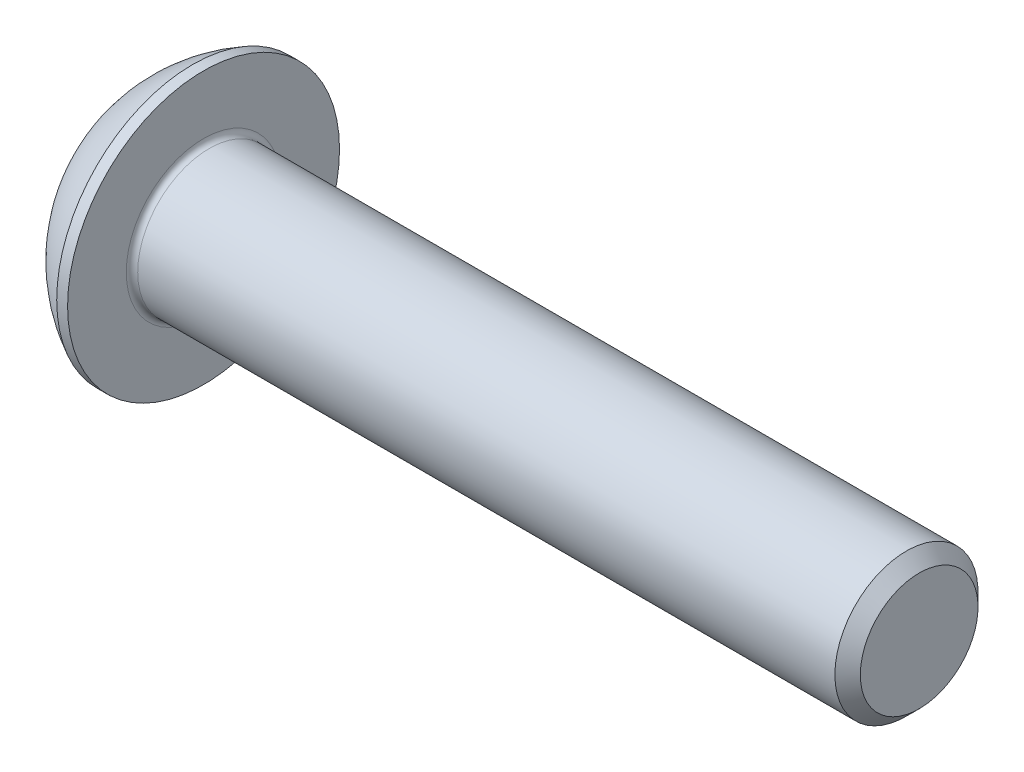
ISO-10303-21;
HEADER;
FILE_DESCRIPTION(('STEP AP214'),'2;1');
FILE_NAME('part.step','',(''),(''),'','','');
FILE_SCHEMA(('AUTOMOTIVE_DESIGN { 1 0 10303 214 1 1 1 1 }'));
ENDSEC;
DATA;
#1=APPLICATION_CONTEXT('core data for automotive mechanical design processes');
#2=APPLICATION_PROTOCOL_DEFINITION('international standard','automotive_design',2000,#1);
#3=PRODUCT_CONTEXT('',#1,'mechanical');
#4=PRODUCT('Part','Part','',(#3));
#5=PRODUCT_RELATED_PRODUCT_CATEGORY('part','',(#4));
#6=PRODUCT_DEFINITION_FORMATION('','',#4);
#7=PRODUCT_DEFINITION_CONTEXT('part definition',#1,'design');
#8=PRODUCT_DEFINITION('design','',#6,#7);
#9=PRODUCT_DEFINITION_SHAPE('','',#8);
#10=(LENGTH_UNIT() NAMED_UNIT(*) SI_UNIT(.MILLI.,.METRE.));
#11=(NAMED_UNIT(*) PLANE_ANGLE_UNIT() SI_UNIT($,.RADIAN.));
#12=(NAMED_UNIT(*) SI_UNIT($,.STERADIAN.) SOLID_ANGLE_UNIT());
#13=UNCERTAINTY_MEASURE_WITH_UNIT(LENGTH_MEASURE(1.E-05),#10,'distance_accuracy_value','');
#14=(GEOMETRIC_REPRESENTATION_CONTEXT(3) GLOBAL_UNCERTAINTY_ASSIGNED_CONTEXT((#13)) GLOBAL_UNIT_ASSIGNED_CONTEXT((#10,
#11,#12)) REPRESENTATION_CONTEXT('',''));
#15=CARTESIAN_POINT('',(0.,0.,0.));
#16=DIRECTION('',(0.,0.,1.));
#17=DIRECTION('',(1.,0.,0.));
#18=AXIS2_PLACEMENT_3D('',#15,#16,#17);
#19=CARTESIAN_POINT('',(0.,0.,0.));
#20=DIRECTION('',(-1.,0.,0.));
#21=DIRECTION('',(0.,0.,1.));
#22=AXIS2_PLACEMENT_3D('',#19,#20,#21);
#23=PLANE('',#22);
#24=CARTESIAN_POINT('',(0.,0.,0.));
#25=DIRECTION('',(-1.,0.,0.));
#26=DIRECTION('',(0.,0.,1.));
#27=AXIS2_PLACEMENT_3D('',#24,#25,#26);
#28=CIRCLE('',#27,2.375);
#29=CARTESIAN_POINT('',(0.,2.375,0.));
#30=VERTEX_POINT('',#29);
#31=EDGE_CURVE('E154',#30,#30,#28,.T.);
#32=ORIENTED_EDGE('',*,*,#31,.T.);
#33=EDGE_LOOP('',(#32));
#34=FACE_BOUND('',#33,.T.);
#35=DIRECTION('',(0.,-1.,0.));
#36=VECTOR('',#35,1.);
#37=CARTESIAN_POINT('',(0.,-0.866025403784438,1.5));
#38=LINE('',#37,#36);
#39=CARTESIAN_POINT('',(0.,0.86602540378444,1.5));
#40=VERTEX_POINT('',#39);
#41=CARTESIAN_POINT('',(0.,-0.866025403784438,1.5));
#42=VERTEX_POINT('',#41);
#43=EDGE_CURVE('E49',#40,#42,#38,.T.);
#44=ORIENTED_EDGE('',*,*,#43,.T.);
#45=DIRECTION('',(0.,-0.5,-0.866025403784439));
#46=VECTOR('',#45,1.);
#47=CARTESIAN_POINT('',(0.,-1.73205080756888,0.));
#48=LINE('',#47,#46);
#49=CARTESIAN_POINT('',(0.,-1.73205080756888,0.));
#50=VERTEX_POINT('',#49);
#51=EDGE_CURVE('E274',#42,#50,#48,.T.);
#52=ORIENTED_EDGE('',*,*,#51,.T.);
#53=DIRECTION('',(0.,0.5,-0.866025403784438));
#54=VECTOR('',#53,1.);
#55=CARTESIAN_POINT('',(0.,-0.866025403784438,-1.5));
#56=LINE('',#55,#54);
#57=CARTESIAN_POINT('',(0.,-0.866025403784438,-1.5));
#58=VERTEX_POINT('',#57);
#59=EDGE_CURVE('E129',#50,#58,#56,.T.);
#60=ORIENTED_EDGE('',*,*,#59,.T.);
#61=DIRECTION('',(0.,1.,0.));
#62=VECTOR('',#61,1.);
#63=CARTESIAN_POINT('',(0.,0.86602540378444,-1.5));
#64=LINE('',#63,#62);
#65=CARTESIAN_POINT('',(0.,0.86602540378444,-1.5));
#66=VERTEX_POINT('',#65);
#67=EDGE_CURVE('E277',#58,#66,#64,.T.);
#68=ORIENTED_EDGE('',*,*,#67,.T.);
#69=DIRECTION('',(0.,0.5,0.866025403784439));
#70=VECTOR('',#69,1.);
#71=CARTESIAN_POINT('',(0.,1.73205080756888,0.));
#72=LINE('',#71,#70);
#73=CARTESIAN_POINT('',(0.,1.73205080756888,0.));
#74=VERTEX_POINT('',#73);
#75=EDGE_CURVE('E279',#66,#74,#72,.T.);
#76=ORIENTED_EDGE('',*,*,#75,.T.);
#77=DIRECTION('',(0.,-0.5,0.866025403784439));
#78=VECTOR('',#77,1.);
#79=CARTESIAN_POINT('',(0.,0.86602540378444,1.5));
#80=LINE('',#79,#78);
#81=EDGE_CURVE('E281',#74,#40,#80,.T.);
#82=ORIENTED_EDGE('',*,*,#81,.T.);
#83=EDGE_LOOP('',(#44,#52,#60,#68,#76,#82));
#84=FACE_BOUND('',#83,.T.);
#85=ADVANCED_FACE('F34',(#34,#84),#23,.T.);
#86=CARTESIAN_POINT('',(4.75501582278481,0.,0.));
#87=DIRECTION('',(-1.,0.,0.));
#88=DIRECTION('',(0.,1.,0.));
#89=AXIS2_PLACEMENT_3D('',#86,#87,#88);
#90=SPHERICAL_SURFACE('',#89,5.3151482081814);
#91=CARTESIAN_POINT('',(2.37,0.,0.));
#92=DIRECTION('',(-1.,0.,0.));
#93=DIRECTION('',(0.,0.,1.));
#94=AXIS2_PLACEMENT_3D('',#91,#92,#93);
#95=CIRCLE('',#94,4.75);
#96=CARTESIAN_POINT('',(2.37,4.75,0.));
#97=VERTEX_POINT('',#96);
#98=EDGE_CURVE('E151',#97,#97,#95,.T.);
#99=CARTESIAN_POINT('',(2.37,4.75,0.));
#100=CARTESIAN_POINT('',(2.33822259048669,4.7340443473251,0.));
#101=CARTESIAN_POINT('',(2.30660534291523,4.71776971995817,0.));
#102=CARTESIAN_POINT('',(2.24370380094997,4.68458927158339,0.));
#103=CARTESIAN_POINT('',(2.21241950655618,4.66768345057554,0.));
#104=CARTESIAN_POINT('',(2.15019650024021,4.6332473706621,0.));
#105=CARTESIAN_POINT('',(2.11925778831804,4.6157171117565,0.));
#106=CARTESIAN_POINT('',(2.05773840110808,4.58003923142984,0.));
#107=CARTESIAN_POINT('',(2.02715772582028,4.56189161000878,0.));
#108=CARTESIAN_POINT('',(1.96636673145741,4.52498631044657,0.));
#109=CARTESIAN_POINT('',(1.93615641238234,4.50622863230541,0.));
#110=CARTESIAN_POINT('',(1.87611829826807,4.46811077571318,0.));
#111=CARTESIAN_POINT('',(1.84629050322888,4.4487505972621,0.));
#112=CARTESIAN_POINT('',(1.78702945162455,4.40943553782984,0.));
#113=CARTESIAN_POINT('',(1.75759619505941,4.38948065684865,0.));
#114=CARTESIAN_POINT('',(1.69913607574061,4.34898423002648,0.));
#115=CARTESIAN_POINT('',(1.67010921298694,4.32844268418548,0.));
#116=CARTESIAN_POINT('',(1.61247357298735,4.28678120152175,0.));
#117=CARTESIAN_POINT('',(1.58386479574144,4.265661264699,0.));
#118=CARTESIAN_POINT('',(1.52707685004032,4.22285150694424,0.));
#119=CARTESIAN_POINT('',(1.49889768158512,4.20116168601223,0.));
#120=CARTESIAN_POINT('',(1.44298030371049,4.15722089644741,0.));
#121=CARTESIAN_POINT('',(1.41524209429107,4.13496992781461,0.));
#122=CARTESIAN_POINT('',(1.36021780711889,4.08991580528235,0.));
#123=CARTESIAN_POINT('',(1.33293172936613,4.06711265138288,0.));
#124=CARTESIAN_POINT('',(1.278822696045,4.02096334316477,0.));
#125=CARTESIAN_POINT('',(1.25199974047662,3.99761718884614,0.));
#126=CARTESIAN_POINT('',(1.19882775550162,3.95039128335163,0.));
#127=CARTESIAN_POINT('',(1.172478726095,3.92651153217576,0.));
#128=CARTESIAN_POINT('',(1.1202652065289,3.87822805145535,0.));
#129=CARTESIAN_POINT('',(1.09440071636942,3.85382432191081,0.));
#130=CARTESIAN_POINT('',(1.04316669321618,3.8045027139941,0.));
#131=CARTESIAN_POINT('',(1.01779716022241,3.77958483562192,0.));
#132=CARTESIAN_POINT('',(0.9675632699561,3.72924496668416,0.));
#133=CARTESIAN_POINT('',(0.942698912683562,3.70382297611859,0.));
#134=CARTESIAN_POINT('',(0.89348538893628,3.65248512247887,0.));
#135=CARTESIAN_POINT('',(0.869136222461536,3.62656925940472,0.));
#136=CARTESIAN_POINT('',(0.82096288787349,3.57425409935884,0.));
#137=CARTESIAN_POINT('',(0.797138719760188,3.54785480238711,0.));
#138=CARTESIAN_POINT('',(0.750024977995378,3.49458340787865,0.));
#139=CARTESIAN_POINT('',(0.726735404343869,3.46771131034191,0.));
#140=CARTESIAN_POINT('',(0.680700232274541,3.41350513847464,0.));
#141=CARTESIAN_POINT('',(0.657954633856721,3.3861710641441,0.));
#142=CARTESIAN_POINT('',(0.613016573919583,3.33105194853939,0.));
#143=CARTESIAN_POINT('',(0.590824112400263,3.30326690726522,0.));
#144=CARTESIAN_POINT('',(0.547001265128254,3.24725704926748,0.));
#145=CARTESIAN_POINT('',(0.525370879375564,3.21903223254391,0.));
#146=CARTESIAN_POINT('',(0.48268089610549,3.16215419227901,0.));
#147=CARTESIAN_POINT('',(0.461621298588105,3.13350096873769,0.));
#148=CARTESIAN_POINT('',(0.420081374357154,3.07577765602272,0.));
#149=CARTESIAN_POINT('',(0.399601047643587,3.04670756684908,0.));
#150=CARTESIAN_POINT('',(0.359227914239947,2.98816223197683,0.));
#151=CARTESIAN_POINT('',(0.339335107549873,2.95868698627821,0.));
#152=CARTESIAN_POINT('',(0.300145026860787,2.89934321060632,0.));
#153=CARTESIAN_POINT('',(0.280847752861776,2.86947468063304,0.));
#154=CARTESIAN_POINT('',(0.242856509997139,2.80935636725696,0.));
#155=CARTESIAN_POINT('',(0.224162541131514,2.77910658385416,0.));
#156=CARTESIAN_POINT('',(0.187385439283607,2.71823794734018,0.));
#157=CARTESIAN_POINT('',(0.169302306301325,2.68761909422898,0.));
#158=CARTESIAN_POINT('',(0.133754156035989,2.626024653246,0.));
#159=CARTESIAN_POINT('',(0.116289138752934,2.59504906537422,0.));
#160=CARTESIAN_POINT('',(0.081984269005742,2.53275362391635,0.));
#161=CARTESIAN_POINT('',(0.0651444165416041,2.50143377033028,0.));
#162=CARTESIAN_POINT('',(0.03209660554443,2.43846244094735,0.));
#163=CARTESIAN_POINT('',(0.0158886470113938,2.40681096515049,0.));
#164=CARTESIAN_POINT('',(0.,2.375,0.));
#165=B_SPLINE_CURVE_WITH_KNOTS('',3,(#99,#100,#101,#102,#103,#104,#105,#106,#107,#108,#109,#110,
#111,#112,#113,#114,#115,#116,#117,#118,#119,#120,#121,#122,#123,#124,#125,#126,#127,#128,#129,
#130,#131,#132,#133,#134,#135,#136,#137,#138,#139,#140,#141,#142,#143,#144,#145,#146,#147,#148,
#149,#150,#151,#152,#153,#154,#155,#156,#157,#158,#159,#160,#161,#162,#163,#164),.UNSPECIFIED.,
.F.,.F.,(4,2,2,2,2,2,2,2,2,2,2,2,2,2,2,2,2,2,2,2,2,2,2,2,2,2,2,2,2,2,2,2,4),(0.,
0.106672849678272,0.213345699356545,0.320018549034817,0.426691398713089,0.533364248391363,
0.640037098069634,0.746709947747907,0.853382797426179,0.960055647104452,1.06672849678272,
1.173401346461,1.28007419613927,1.38674704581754,1.49341989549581,1.60009274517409,
1.70676559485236,1.81343844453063,1.9201112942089,2.02678414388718,2.13345699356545,
2.24012984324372,2.34680269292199,2.45347554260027,2.56014839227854,2.66682124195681,
2.77349409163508,2.88016694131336,2.98683979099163,3.0935126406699,3.20018549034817,
3.30685834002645,3.41353118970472),.UNSPECIFIED.);
#166=EDGE_CURVE('BSEAM175',#97,#30,#165,.T.);
#167=ORIENTED_EDGE('',*,*,#98,.T.);
#168=ORIENTED_EDGE('',*,*,#31,.F.);
#169=ORIENTED_EDGE('',*,*,#166,.T.);
#170=ORIENTED_EDGE('',*,*,#166,.F.);
#171=EDGE_LOOP('',(#167,#169,#168,#170));
#172=FACE_BOUND('',#171,.T.);
#173=ADVANCED_FACE('F175',(#172),#90,.T.);
#174=CARTESIAN_POINT('',(0.,0.,0.));
#175=DIRECTION('',(-1.,0.,0.));
#176=DIRECTION('',(0.,0.,1.));
#177=AXIS2_PLACEMENT_3D('',#174,#175,#176);
#178=CYLINDRICAL_SURFACE('',#177,4.75);
#179=ORIENTED_EDGE('',*,*,#98,.F.);
#180=EDGE_LOOP('',(#179));
#181=FACE_BOUND('',#180,.T.);
#182=CARTESIAN_POINT('',(2.75,0.,0.));
#183=DIRECTION('',(-1.,0.,0.));
#184=DIRECTION('',(0.,0.,1.));
#185=AXIS2_PLACEMENT_3D('',#182,#183,#184);
#186=CIRCLE('',#185,4.75);
#187=CARTESIAN_POINT('',(2.75,0.,4.75));
#188=VERTEX_POINT('',#187);
#189=EDGE_CURVE('E148',#188,#188,#186,.T.);
#190=ORIENTED_EDGE('',*,*,#189,.T.);
#191=EDGE_LOOP('',(#190));
#192=FACE_BOUND('',#191,.T.);
#193=ADVANCED_FACE('F180',(#181,#192),#178,.T.);
#194=CARTESIAN_POINT('',(2.75,2.49999999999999,0.));
#195=DIRECTION('',(-1.,0.,0.));
#196=DIRECTION('',(0.,0.,1.));
#197=AXIS2_PLACEMENT_3D('',#194,#195,#196);
#198=PLANE('',#197);
#199=CARTESIAN_POINT('',(2.75,0.,0.));
#200=DIRECTION('',(-1.,0.,0.));
#201=DIRECTION('',(0.,0.,1.));
#202=AXIS2_PLACEMENT_3D('',#199,#200,#201);
#203=CIRCLE('',#202,2.69999999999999);
#204=CARTESIAN_POINT('',(2.75,0.,2.69999999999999));
#205=VERTEX_POINT('',#204);
#206=EDGE_CURVE('E42',#205,#205,#203,.T.);
#207=ORIENTED_EDGE('',*,*,#206,.T.);
#208=EDGE_LOOP('',(#207));
#209=FACE_BOUND('',#208,.T.);
#210=ORIENTED_EDGE('',*,*,#189,.F.);
#211=EDGE_LOOP('',(#210));
#212=FACE_BOUND('',#211,.T.);
#213=ADVANCED_FACE('F159',(#209,#212),#198,.F.);
#214=CARTESIAN_POINT('',(0.,0.,0.));
#215=DIRECTION('',(-1.,0.,0.));
#216=DIRECTION('',(0.,0.,1.));
#217=AXIS2_PLACEMENT_3D('',#214,#215,#216);
#218=CYLINDRICAL_SURFACE('',#217,2.49999999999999);
#219=CARTESIAN_POINT('',(2.95,0.,0.));
#220=DIRECTION('',(-1.,0.,0.));
#221=DIRECTION('',(0.,0.,1.));
#222=AXIS2_PLACEMENT_3D('',#219,#220,#221);
#223=CIRCLE('',#222,2.49999999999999);
#224=CARTESIAN_POINT('',(2.95,0.,2.49999999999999));
#225=VERTEX_POINT('',#224);
#226=EDGE_CURVE('E11',#225,#225,#223,.F.);
#227=ORIENTED_EDGE('',*,*,#226,.T.);
#228=EDGE_LOOP('',(#227));
#229=FACE_BOUND('',#228,.T.);
#230=CARTESIAN_POINT('',(27.305,0.,0.));
#231=DIRECTION('',(-1.,0.,0.));
#232=DIRECTION('',(0.,0.,1.));
#233=AXIS2_PLACEMENT_3D('',#230,#231,#232);
#234=CIRCLE('',#233,2.49999999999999);
#235=CARTESIAN_POINT('',(27.305,0.,2.49999999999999));
#236=VERTEX_POINT('',#235);
#237=EDGE_CURVE('E145',#236,#236,#234,.T.);
#238=ORIENTED_EDGE('',*,*,#237,.T.);
#239=EDGE_LOOP('',(#238));
#240=FACE_BOUND('',#239,.T.);
#241=ADVANCED_FACE('F189',(#229,#240),#218,.T.);
#242=CARTESIAN_POINT('',(27.75,0.,0.));
#243=DIRECTION('',(-1.,0.,0.));
#244=DIRECTION('',(0.,0.,1.));
#245=AXIS2_PLACEMENT_3D('',#242,#243,#244);
#246=CONICAL_SURFACE('',#245,2.055,0.785398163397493);
#247=ORIENTED_EDGE('',*,*,#237,.F.);
#248=EDGE_LOOP('',(#247));
#249=FACE_BOUND('',#248,.T.);
#250=CARTESIAN_POINT('',(27.75,0.,0.));
#251=DIRECTION('',(-1.,0.,0.));
#252=DIRECTION('',(0.,0.,1.));
#253=AXIS2_PLACEMENT_3D('',#250,#251,#252);
#254=CIRCLE('',#253,2.055);
#255=CARTESIAN_POINT('',(27.75,0.,2.055));
#256=VERTEX_POINT('',#255);
#257=EDGE_CURVE('E141',#256,#256,#254,.T.);
#258=ORIENTED_EDGE('',*,*,#257,.T.);
#259=EDGE_LOOP('',(#258));
#260=FACE_BOUND('',#259,.T.);
#261=ADVANCED_FACE('F170',(#249,#260),#246,.T.);
#262=CARTESIAN_POINT('',(27.75,0.,0.));
#263=DIRECTION('',(-1.,0.,0.));
#264=DIRECTION('',(0.,0.,1.));
#265=AXIS2_PLACEMENT_3D('',#262,#263,#264);
#266=PLANE('',#265);
#267=ORIENTED_EDGE('',*,*,#257,.F.);
#268=EDGE_LOOP('',(#267));
#269=FACE_BOUND('',#268,.T.);
#270=ADVANCED_FACE('F163',(#269),#266,.F.);
#271=CARTESIAN_POINT('',(2.95,0.,0.));
#272=DIRECTION('',(-1.,0.,0.));
#273=DIRECTION('',(0.,0.,1.));
#274=AXIS2_PLACEMENT_3D('',#271,#272,#273);
#275=TOROIDAL_SURFACE('',#274,2.69999999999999,0.2);
#276=ORIENTED_EDGE('',*,*,#226,.F.);
#277=EDGE_LOOP('',(#276));
#278=FACE_BOUND('',#277,.T.);
#279=ORIENTED_EDGE('',*,*,#206,.F.);
#280=EDGE_LOOP('',(#279));
#281=FACE_BOUND('',#280,.T.);
#282=ADVANCED_FACE('F36',(#278,#281),#275,.F.);
#283=CARTESIAN_POINT('',(1.56,-1.73205080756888,0.));
#284=DIRECTION('',(0.,0.866025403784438,-0.5));
#285=DIRECTION('',(0.,0.5,0.866025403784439));
#286=AXIS2_PLACEMENT_3D('',#283,#284,#285);
#287=PLANE('',#286);
#288=DIRECTION('',(0.,-0.5,-0.866025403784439));
#289=VECTOR('',#288,1.);
#290=CARTESIAN_POINT('',(1.56,-1.73205080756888,0.));
#291=LINE('',#290,#289);
#292=CARTESIAN_POINT('',(1.56,-0.866025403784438,1.5));
#293=VERTEX_POINT('',#292);
#294=CARTESIAN_POINT('',(1.56,-1.29903810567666,0.75));
#295=VERTEX_POINT('',#294);
#296=EDGE_CURVE('E115',#293,#295,#291,.T.);
#297=ORIENTED_EDGE('',*,*,#296,.T.);
#298=CARTESIAN_POINT('',(1.56,-1.73205080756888,0.));
#299=VERTEX_POINT('',#298);
#300=EDGE_CURVE('E110',#295,#299,#291,.T.);
#301=ORIENTED_EDGE('',*,*,#300,.T.);
#302=DIRECTION('',(-1.,0.,0.));
#303=VECTOR('',#302,1.);
#304=CARTESIAN_POINT('',(1.56,-1.73205080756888,0.));
#305=LINE('',#304,#303);
#306=EDGE_CURVE('E112',#299,#50,#305,.T.);
#307=ORIENTED_EDGE('',*,*,#306,.T.);
#308=ORIENTED_EDGE('',*,*,#51,.F.);
#309=DIRECTION('',(-1.,0.,0.));
#310=VECTOR('',#309,1.);
#311=CARTESIAN_POINT('',(1.56,-0.866025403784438,1.5));
#312=LINE('',#311,#310);
#313=EDGE_CURVE('E270',#293,#42,#312,.T.);
#314=ORIENTED_EDGE('',*,*,#313,.F.);
#315=EDGE_LOOP('',(#297,#301,#307,#308,#314));
#316=FACE_BOUND('',#315,.T.);
#317=ADVANCED_FACE('F111',(#316),#287,.T.);
#318=CARTESIAN_POINT('',(1.56,-0.866025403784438,-1.5));
#319=DIRECTION('',(0.,0.866025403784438,0.5));
#320=DIRECTION('',(0.,-0.5,0.866025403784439));
#321=AXIS2_PLACEMENT_3D('',#318,#319,#320);
#322=PLANE('',#321);
#323=DIRECTION('',(0.,0.5,-0.866025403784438));
#324=VECTOR('',#323,1.);
#325=CARTESIAN_POINT('',(1.56,-0.866025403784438,-1.5));
#326=LINE('',#325,#324);
#327=CARTESIAN_POINT('',(1.56,-1.29903810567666,-0.75));
#328=VERTEX_POINT('',#327);
#329=EDGE_CURVE('E57',#299,#328,#326,.T.);
#330=ORIENTED_EDGE('',*,*,#329,.T.);
#331=CARTESIAN_POINT('',(1.56,-0.866025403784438,-1.5));
#332=VERTEX_POINT('',#331);
#333=EDGE_CURVE('E124',#328,#332,#326,.T.);
#334=ORIENTED_EDGE('',*,*,#333,.T.);
#335=DIRECTION('',(-1.,0.,0.));
#336=VECTOR('',#335,1.);
#337=CARTESIAN_POINT('',(1.56,-0.866025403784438,-1.5));
#338=LINE('',#337,#336);
#339=EDGE_CURVE('E131',#332,#58,#338,.T.);
#340=ORIENTED_EDGE('',*,*,#339,.T.);
#341=ORIENTED_EDGE('',*,*,#59,.F.);
#342=ORIENTED_EDGE('',*,*,#306,.F.);
#343=EDGE_LOOP('',(#330,#334,#340,#341,#342));
#344=FACE_BOUND('',#343,.T.);
#345=ADVANCED_FACE('F127',(#344),#322,.T.);
#346=CARTESIAN_POINT('',(1.56,0.86602540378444,-1.5));
#347=DIRECTION('',(0.,0.,1.));
#348=DIRECTION('',(1.,0.,0.));
#349=AXIS2_PLACEMENT_3D('',#346,#347,#348);
#350=PLANE('',#349);
#351=DIRECTION('',(0.,1.,0.));
#352=VECTOR('',#351,1.);
#353=CARTESIAN_POINT('',(1.56,0.86602540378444,-1.5));
#354=LINE('',#353,#352);
#355=CARTESIAN_POINT('',(1.56,0.,-1.5));
#356=VERTEX_POINT('',#355);
#357=EDGE_CURVE('E251',#332,#356,#354,.T.);
#358=ORIENTED_EDGE('',*,*,#357,.T.);
#359=CARTESIAN_POINT('',(1.56,0.86602540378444,-1.5));
#360=VERTEX_POINT('',#359);
#361=EDGE_CURVE('E123',#356,#360,#354,.T.);
#362=ORIENTED_EDGE('',*,*,#361,.T.);
#363=DIRECTION('',(-1.,0.,0.));
#364=VECTOR('',#363,1.);
#365=CARTESIAN_POINT('',(1.56,0.86602540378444,-1.5));
#366=LINE('',#365,#364);
#367=EDGE_CURVE('E136',#360,#66,#366,.T.);
#368=ORIENTED_EDGE('',*,*,#367,.T.);
#369=ORIENTED_EDGE('',*,*,#67,.F.);
#370=ORIENTED_EDGE('',*,*,#339,.F.);
#371=EDGE_LOOP('',(#358,#362,#368,#369,#370));
#372=FACE_BOUND('',#371,.T.);
#373=ADVANCED_FACE('F203',(#372),#350,.T.);
#374=CARTESIAN_POINT('',(1.56,1.73205080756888,0.));
#375=DIRECTION('',(0.,-0.866025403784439,0.5));
#376=DIRECTION('',(0.,-0.5,-0.866025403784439));
#377=AXIS2_PLACEMENT_3D('',#374,#375,#376);
#378=PLANE('',#377);
#379=DIRECTION('',(0.,0.5,0.866025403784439));
#380=VECTOR('',#379,1.);
#381=CARTESIAN_POINT('',(1.56,1.73205080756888,0.));
#382=LINE('',#381,#380);
#383=CARTESIAN_POINT('',(1.56,1.29903810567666,-0.750000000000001));
#384=VERTEX_POINT('',#383);
#385=EDGE_CURVE('E240',#360,#384,#382,.T.);
#386=ORIENTED_EDGE('',*,*,#385,.T.);
#387=CARTESIAN_POINT('',(1.56,1.73205080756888,0.));
#388=VERTEX_POINT('',#387);
#389=EDGE_CURVE('E245',#384,#388,#382,.T.);
#390=ORIENTED_EDGE('',*,*,#389,.T.);
#391=DIRECTION('',(-1.,0.,0.));
#392=VECTOR('',#391,1.);
#393=CARTESIAN_POINT('',(1.56,1.73205080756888,0.));
#394=LINE('',#393,#392);
#395=EDGE_CURVE('E285',#388,#74,#394,.T.);
#396=ORIENTED_EDGE('',*,*,#395,.T.);
#397=ORIENTED_EDGE('',*,*,#75,.F.);
#398=ORIENTED_EDGE('',*,*,#367,.F.);
#399=EDGE_LOOP('',(#386,#390,#396,#397,#398));
#400=FACE_BOUND('',#399,.T.);
#401=ADVANCED_FACE('F206',(#400),#378,.T.);
#402=CARTESIAN_POINT('',(1.56,0.86602540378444,1.5));
#403=DIRECTION('',(0.,-0.866025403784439,-0.5));
#404=DIRECTION('',(0.,0.5,-0.866025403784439));
#405=AXIS2_PLACEMENT_3D('',#402,#403,#404);
#406=PLANE('',#405);
#407=DIRECTION('',(0.,-0.5,0.866025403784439));
#408=VECTOR('',#407,1.);
#409=CARTESIAN_POINT('',(1.56,0.86602540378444,1.5));
#410=LINE('',#409,#408);
#411=CARTESIAN_POINT('',(1.56,1.29903810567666,0.75));
#412=VERTEX_POINT('',#411);
#413=EDGE_CURVE('E248',#388,#412,#410,.T.);
#414=ORIENTED_EDGE('',*,*,#413,.T.);
#415=CARTESIAN_POINT('',(1.56,0.86602540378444,1.5));
#416=VERTEX_POINT('',#415);
#417=EDGE_CURVE('E256',#412,#416,#410,.T.);
#418=ORIENTED_EDGE('',*,*,#417,.T.);
#419=DIRECTION('',(-1.,0.,0.));
#420=VECTOR('',#419,1.);
#421=CARTESIAN_POINT('',(1.56,0.86602540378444,1.5));
#422=LINE('',#421,#420);
#423=EDGE_CURVE('E269',#416,#40,#422,.T.);
#424=ORIENTED_EDGE('',*,*,#423,.T.);
#425=ORIENTED_EDGE('',*,*,#81,.F.);
#426=ORIENTED_EDGE('',*,*,#395,.F.);
#427=EDGE_LOOP('',(#414,#418,#424,#425,#426));
#428=FACE_BOUND('',#427,.T.);
#429=ADVANCED_FACE('F210',(#428),#406,.T.);
#430=CARTESIAN_POINT('',(1.56,-0.866025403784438,1.5));
#431=DIRECTION('',(0.,0.,-1.));
#432=DIRECTION('',(0.,1.,0.));
#433=AXIS2_PLACEMENT_3D('',#430,#431,#432);
#434=PLANE('',#433);
#435=DIRECTION('',(0.,-1.,0.));
#436=VECTOR('',#435,1.);
#437=CARTESIAN_POINT('',(1.56,-0.866025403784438,1.5));
#438=LINE('',#437,#436);
#439=CARTESIAN_POINT('',(1.56,0.,1.5));
#440=VERTEX_POINT('',#439);
#441=EDGE_CURVE('E262',#416,#440,#438,.T.);
#442=ORIENTED_EDGE('',*,*,#441,.T.);
#443=EDGE_CURVE('E264',#440,#293,#438,.T.);
#444=ORIENTED_EDGE('',*,*,#443,.T.);
#445=ORIENTED_EDGE('',*,*,#313,.T.);
#446=ORIENTED_EDGE('',*,*,#43,.F.);
#447=ORIENTED_EDGE('',*,*,#423,.F.);
#448=EDGE_LOOP('',(#442,#444,#445,#446,#447));
#449=FACE_BOUND('',#448,.T.);
#450=ADVANCED_FACE('F214',(#449),#434,.T.);
#451=CARTESIAN_POINT('',(1.56,-1.73205080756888,0.));
#452=DIRECTION('',(1.,0.,0.));
#453=DIRECTION('',(0.,0.,-1.));
#454=AXIS2_PLACEMENT_3D('',#451,#452,#453);
#455=PLANE('',#454);
#456=CARTESIAN_POINT('',(1.56,0.,0.));
#457=DIRECTION('',(-1.,0.,0.));
#458=DIRECTION('',(0.,0.,1.));
#459=AXIS2_PLACEMENT_3D('',#456,#457,#458);
#460=CIRCLE('',#459,1.5);
#461=EDGE_CURVE('E237',#384,#356,#460,.T.);
#462=ORIENTED_EDGE('',*,*,#461,.F.);
#463=ORIENTED_EDGE('',*,*,#385,.F.);
#464=ORIENTED_EDGE('',*,*,#361,.F.);
#465=EDGE_LOOP('',(#462,#463,#464));
#466=FACE_BOUND('',#465,.T.);
#467=ADVANCED_FACE('F218',(#466),#455,.F.);
#468=EDGE_CURVE('E142',#412,#384,#460,.T.);
#469=ORIENTED_EDGE('',*,*,#468,.F.);
#470=ORIENTED_EDGE('',*,*,#413,.F.);
#471=ORIENTED_EDGE('',*,*,#389,.F.);
#472=EDGE_LOOP('',(#469,#470,#471));
#473=FACE_BOUND('',#472,.T.);
#474=ADVANCED_FACE('F227',(#473),#455,.F.);
#475=EDGE_CURVE('E135',#440,#412,#460,.T.);
#476=ORIENTED_EDGE('',*,*,#475,.F.);
#477=ORIENTED_EDGE('',*,*,#441,.F.);
#478=ORIENTED_EDGE('',*,*,#417,.F.);
#479=EDGE_LOOP('',(#476,#477,#478));
#480=FACE_BOUND('',#479,.T.);
#481=ADVANCED_FACE('F232',(#480),#455,.F.);
#482=EDGE_CURVE('E130',#295,#440,#460,.T.);
#483=ORIENTED_EDGE('',*,*,#482,.F.);
#484=ORIENTED_EDGE('',*,*,#296,.F.);
#485=ORIENTED_EDGE('',*,*,#443,.F.);
#486=EDGE_LOOP('',(#483,#484,#485));
#487=FACE_BOUND('',#486,.T.);
#488=ADVANCED_FACE('F225',(#487),#455,.F.);
#489=EDGE_CURVE('E121',#328,#295,#460,.T.);
#490=ORIENTED_EDGE('',*,*,#489,.F.);
#491=ORIENTED_EDGE('',*,*,#329,.F.);
#492=ORIENTED_EDGE('',*,*,#300,.F.);
#493=EDGE_LOOP('',(#490,#491,#492));
#494=FACE_BOUND('',#493,.T.);
#495=ADVANCED_FACE('F120',(#494),#455,.F.);
#496=EDGE_CURVE('E243',#356,#328,#460,.T.);
#497=ORIENTED_EDGE('',*,*,#496,.F.);
#498=ORIENTED_EDGE('',*,*,#357,.F.);
#499=ORIENTED_EDGE('',*,*,#333,.F.);
#500=EDGE_LOOP('',(#497,#498,#499));
#501=FACE_BOUND('',#500,.T.);
#502=ADVANCED_FACE('F198',(#501),#455,.F.);
#503=CARTESIAN_POINT('',(2.42602540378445,0.,0.));
#504=DIRECTION('',(-1.,0.,0.));
#505=DIRECTION('',(0.,0.,1.));
#506=AXIS2_PLACEMENT_3D('',#503,#504,#505);
#507=CONICAL_SURFACE('',#506,0.,1.04719755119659);
#508=ORIENTED_EDGE('',*,*,#475,.T.);
#509=ORIENTED_EDGE('',*,*,#468,.T.);
#510=ORIENTED_EDGE('',*,*,#461,.T.);
#511=ORIENTED_EDGE('',*,*,#496,.T.);
#512=ORIENTED_EDGE('',*,*,#489,.T.);
#513=ORIENTED_EDGE('',*,*,#482,.T.);
#514=EDGE_LOOP('',(#508,#509,#510,#511,#512,#513));
#515=FACE_BOUND('',#514,.T.);
#516=CARTESIAN_POINT('',(2.42602540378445,0.,0.));
#517=VERTEX_POINT('',#516);
#518=VERTEX_LOOP('',#517);
#519=FACE_BOUND('',#518,.T.);
#520=ADVANCED_FACE('F196',(#515,#519),#507,.F.);
#521=CLOSED_SHELL('',(#85,#173,#193,#213,#241,#261,#270,#282,#317,#345,#373,#401,#429,#450,#467,
#474,#481,#488,#495,#502,#520));
#522=MANIFOLD_SOLID_BREP('B2',#521);
#523=ADVANCED_BREP_SHAPE_REPRESENTATION('',(#18,#522),#14);
#524=SHAPE_DEFINITION_REPRESENTATION(#9,#523);
ENDSEC;
END-ISO-10303-21;
